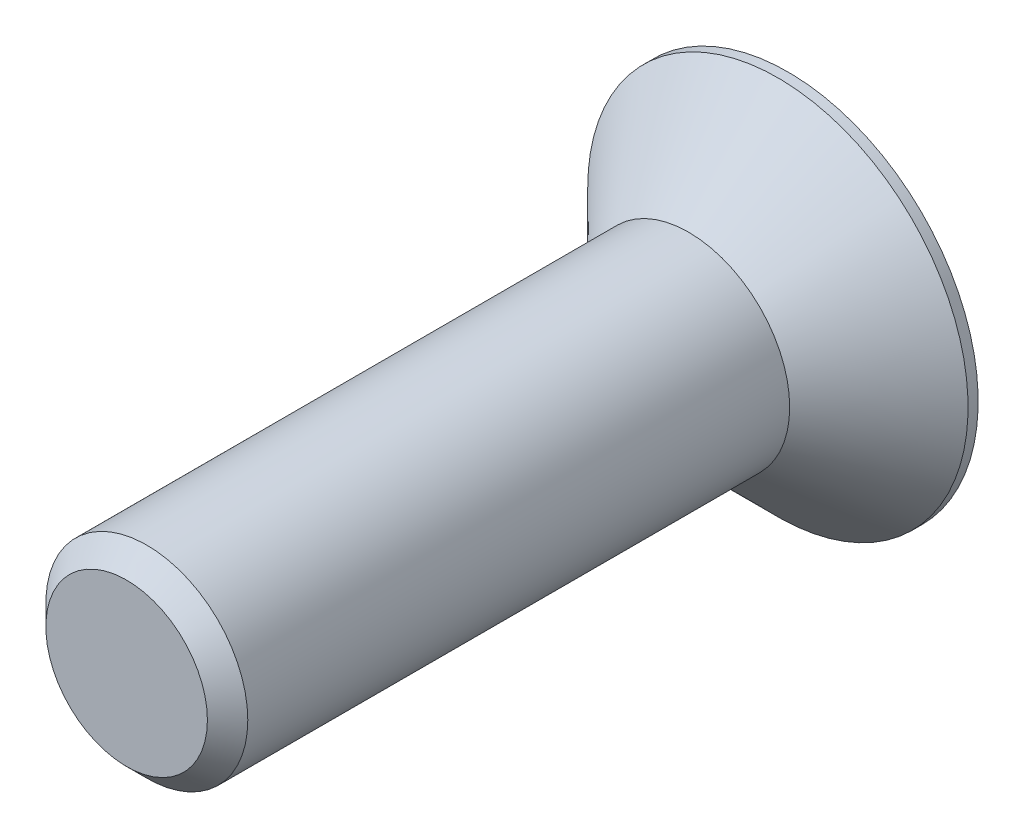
ISO-10303-21;
HEADER;
FILE_DESCRIPTION(('STEP AP214'),'2;1');
FILE_NAME('part.step','',(''),(''),'','','');
FILE_SCHEMA(('AUTOMOTIVE_DESIGN { 1 0 10303 214 1 1 1 1 }'));
ENDSEC;
DATA;
#1=APPLICATION_CONTEXT('core data for automotive mechanical design processes');
#2=APPLICATION_PROTOCOL_DEFINITION('international standard','automotive_design',2000,#1);
#3=PRODUCT_CONTEXT('',#1,'mechanical');
#4=PRODUCT('Part','Part','',(#3));
#5=PRODUCT_RELATED_PRODUCT_CATEGORY('part','',(#4));
#6=PRODUCT_DEFINITION_FORMATION('','',#4);
#7=PRODUCT_DEFINITION_CONTEXT('part definition',#1,'design');
#8=PRODUCT_DEFINITION('design','',#6,#7);
#9=PRODUCT_DEFINITION_SHAPE('','',#8);
#10=(LENGTH_UNIT() NAMED_UNIT(*) SI_UNIT(.MILLI.,.METRE.));
#11=(NAMED_UNIT(*) PLANE_ANGLE_UNIT() SI_UNIT($,.RADIAN.));
#12=(NAMED_UNIT(*) SI_UNIT($,.STERADIAN.) SOLID_ANGLE_UNIT());
#13=UNCERTAINTY_MEASURE_WITH_UNIT(LENGTH_MEASURE(1.E-05),#10,'distance_accuracy_value','');
#14=(GEOMETRIC_REPRESENTATION_CONTEXT(3) GLOBAL_UNCERTAINTY_ASSIGNED_CONTEXT((#13)) GLOBAL_UNIT_ASSIGNED_CONTEXT((#10,
#11,#12)) REPRESENTATION_CONTEXT('',''));
#15=CARTESIAN_POINT('',(0.,0.,0.));
#16=DIRECTION('',(0.,0.,1.));
#17=DIRECTION('',(1.,0.,0.));
#18=AXIS2_PLACEMENT_3D('',#15,#16,#17);
#19=CARTESIAN_POINT('',(5.65,0.,-2.94999999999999));
#20=DIRECTION('',(0.,0.,1.));
#21=DIRECTION('',(1.,0.,0.));
#22=AXIS2_PLACEMENT_3D('',#19,#20,#21);
#23=PLANE('',#22);
#24=CARTESIAN_POINT('',(0.,0.,-2.94999999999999));
#25=DIRECTION('',(0.,0.,-1.));
#26=DIRECTION('',(-1.,0.,0.));
#27=AXIS2_PLACEMENT_3D('',#24,#25,#26);
#28=CIRCLE('',#27,5.65);
#29=CARTESIAN_POINT('',(-5.65,0.,-2.94999999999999));
#30=VERTEX_POINT('',#29);
#31=EDGE_CURVE('E145',#30,#30,#28,.T.);
#32=ORIENTED_EDGE('',*,*,#31,.T.);
#33=EDGE_LOOP('',(#32));
#34=FACE_BOUND('',#33,.T.);
#35=DIRECTION('',(-0.86602540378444,0.499999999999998,0.));
#36=VECTOR('',#35,1.);
#37=CARTESIAN_POINT('',(0.,2.30940107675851,-2.94999999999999));
#38=LINE('',#37,#36);
#39=CARTESIAN_POINT('',(2.,1.15470053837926,-2.94999999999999));
#40=VERTEX_POINT('',#39);
#41=CARTESIAN_POINT('',(0.,2.30940107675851,-2.94999999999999));
#42=VERTEX_POINT('',#41);
#43=EDGE_CURVE('E50',#40,#42,#38,.T.);
#44=ORIENTED_EDGE('',*,*,#43,.T.);
#45=DIRECTION('',(-0.866025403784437,-0.500000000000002,0.));
#46=VECTOR('',#45,1.);
#47=CARTESIAN_POINT('',(-2.,1.15470053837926,-2.94999999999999));
#48=LINE('',#47,#46);
#49=CARTESIAN_POINT('',(-2.,1.15470053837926,-2.94999999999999));
#50=VERTEX_POINT('',#49);
#51=EDGE_CURVE('E121',#42,#50,#48,.T.);
#52=ORIENTED_EDGE('',*,*,#51,.T.);
#53=DIRECTION('',(0.,-1.,0.));
#54=VECTOR('',#53,1.);
#55=CARTESIAN_POINT('',(-2.,-1.15470053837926,-2.94999999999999));
#56=LINE('',#55,#54);
#57=CARTESIAN_POINT('',(-2.,-1.15470053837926,-2.94999999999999));
#58=VERTEX_POINT('',#57);
#59=EDGE_CURVE('E125',#50,#58,#56,.T.);
#60=ORIENTED_EDGE('',*,*,#59,.T.);
#61=DIRECTION('',(0.866025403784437,-0.500000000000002,0.));
#62=VECTOR('',#61,1.);
#63=CARTESIAN_POINT('',(-2.,-1.15470053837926,-2.94999999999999));
#64=LINE('',#63,#62);
#65=CARTESIAN_POINT('',(0.,-2.30940107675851,-2.94999999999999));
#66=VERTEX_POINT('',#65);
#67=EDGE_CURVE('E128',#58,#66,#64,.T.);
#68=ORIENTED_EDGE('',*,*,#67,.T.);
#69=DIRECTION('',(0.86602540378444,0.499999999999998,0.));
#70=VECTOR('',#69,1.);
#71=CARTESIAN_POINT('',(0.,-2.30940107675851,-2.94999999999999));
#72=LINE('',#71,#70);
#73=CARTESIAN_POINT('',(2.,-1.15470053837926,-2.94999999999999));
#74=VERTEX_POINT('',#73);
#75=EDGE_CURVE('E111',#66,#74,#72,.T.);
#76=ORIENTED_EDGE('',*,*,#75,.T.);
#77=DIRECTION('',(0.,1.,0.));
#78=VECTOR('',#77,1.);
#79=CARTESIAN_POINT('',(2.,-1.15470053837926,-2.94999999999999));
#80=LINE('',#79,#78);
#81=EDGE_CURVE('E131',#74,#40,#80,.T.);
#82=ORIENTED_EDGE('',*,*,#81,.T.);
#83=EDGE_LOOP('',(#44,#52,#60,#68,#76,#82));
#84=FACE_BOUND('',#83,.T.);
#85=ADVANCED_FACE('F35',(#34,#84),#23,.F.);
#86=CARTESIAN_POINT('',(0.,0.,0.));
#87=DIRECTION('',(0.,0.,-1.));
#88=DIRECTION('',(-1.,0.,0.));
#89=AXIS2_PLACEMENT_3D('',#86,#87,#88);
#90=CYLINDRICAL_SURFACE('',#89,5.65);
#91=ORIENTED_EDGE('',*,*,#31,.F.);
#92=EDGE_LOOP('',(#91));
#93=FACE_BOUND('',#92,.T.);
#94=CARTESIAN_POINT('',(0.,0.,-2.64999999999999));
#95=DIRECTION('',(0.,0.,-1.));
#96=DIRECTION('',(-1.,0.,0.));
#97=AXIS2_PLACEMENT_3D('',#94,#95,#96);
#98=CIRCLE('',#97,5.65);
#99=CARTESIAN_POINT('',(-5.65,0.,-2.64999999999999));
#100=VERTEX_POINT('',#99);
#101=EDGE_CURVE('E142',#100,#100,#98,.T.);
#102=ORIENTED_EDGE('',*,*,#101,.T.);
#103=EDGE_LOOP('',(#102));
#104=FACE_BOUND('',#103,.T.);
#105=ADVANCED_FACE('F162',(#93,#104),#90,.T.);
#106=CARTESIAN_POINT('',(0.,0.,0.));
#107=DIRECTION('',(0.,0.,-1.));
#108=DIRECTION('',(-1.,0.,0.));
#109=AXIS2_PLACEMENT_3D('',#106,#107,#108);
#110=CONICAL_SURFACE('',#109,3.,0.78539816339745);
#111=ORIENTED_EDGE('',*,*,#101,.F.);
#112=EDGE_LOOP('',(#111));
#113=FACE_BOUND('',#112,.T.);
#114=CARTESIAN_POINT('',(0.,0.,0.));
#115=DIRECTION('',(0.,0.,1.));
#116=DIRECTION('',(1.,0.,0.));
#117=AXIS2_PLACEMENT_3D('',#114,#115,#116);
#118=CIRCLE('',#117,3.);
#119=CARTESIAN_POINT('',(3.,0.,0.));
#120=VERTEX_POINT('',#119);
#121=EDGE_CURVE('E122',#120,#120,#118,.T.);
#122=ORIENTED_EDGE('',*,*,#121,.F.);
#123=EDGE_LOOP('',(#122));
#124=FACE_BOUND('',#123,.T.);
#125=ADVANCED_FACE('F167',(#113,#124),#110,.T.);
#126=CARTESIAN_POINT('',(0.,2.30940107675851,-0.149999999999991));
#127=DIRECTION('',(-0.499999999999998,-0.86602540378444,0.));
#128=DIRECTION('',(0.86602540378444,-0.499999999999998,0.));
#129=AXIS2_PLACEMENT_3D('',#126,#127,#128);
#130=PLANE('',#129);
#131=ORIENTED_EDGE('',*,*,#43,.F.);
#132=DIRECTION('',(0.,0.,-1.));
#133=VECTOR('',#132,1.);
#134=CARTESIAN_POINT('',(2.,1.15470053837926,-0.149999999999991));
#135=LINE('',#134,#133);
#136=CARTESIAN_POINT('',(2.,1.15470053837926,-0.149999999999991));
#137=VERTEX_POINT('',#136);
#138=EDGE_CURVE('E116',#137,#40,#135,.T.);
#139=ORIENTED_EDGE('',*,*,#138,.F.);
#140=DIRECTION('',(-0.86602540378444,0.499999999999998,0.));
#141=VECTOR('',#140,1.);
#142=CARTESIAN_POINT('',(0.,2.30940107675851,-0.149999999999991));
#143=LINE('',#142,#141);
#144=CARTESIAN_POINT('',(0.,2.30940107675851,-0.149999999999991));
#145=VERTEX_POINT('',#144);
#146=EDGE_CURVE('E134',#137,#145,#143,.T.);
#147=ORIENTED_EDGE('',*,*,#146,.T.);
#148=DIRECTION('',(0.,0.,-1.));
#149=VECTOR('',#148,1.);
#150=CARTESIAN_POINT('',(0.,2.30940107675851,-0.149999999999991));
#151=LINE('',#150,#149);
#152=EDGE_CURVE('E140',#145,#42,#151,.T.);
#153=ORIENTED_EDGE('',*,*,#152,.T.);
#154=EDGE_LOOP('',(#131,#139,#147,#153));
#155=FACE_BOUND('',#154,.T.);
#156=ADVANCED_FACE('F174',(#155),#130,.T.);
#157=CARTESIAN_POINT('',(-2.,1.15470053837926,-0.149999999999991));
#158=DIRECTION('',(0.500000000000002,-0.866025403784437,0.));
#159=DIRECTION('',(0.866025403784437,0.500000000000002,0.));
#160=AXIS2_PLACEMENT_3D('',#157,#158,#159);
#161=PLANE('',#160);
#162=ORIENTED_EDGE('',*,*,#51,.F.);
#163=ORIENTED_EDGE('',*,*,#152,.F.);
#164=DIRECTION('',(-0.866025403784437,-0.500000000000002,0.));
#165=VECTOR('',#164,1.);
#166=CARTESIAN_POINT('',(-2.,1.15470053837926,-0.149999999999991));
#167=LINE('',#166,#165);
#168=CARTESIAN_POINT('',(-2.,1.15470053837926,-0.149999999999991));
#169=VERTEX_POINT('',#168);
#170=EDGE_CURVE('E89',#145,#169,#167,.T.);
#171=ORIENTED_EDGE('',*,*,#170,.T.);
#172=DIRECTION('',(0.,0.,-1.));
#173=VECTOR('',#172,1.);
#174=CARTESIAN_POINT('',(-2.,1.15470053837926,-0.149999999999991));
#175=LINE('',#174,#173);
#176=EDGE_CURVE('E138',#169,#50,#175,.T.);
#177=ORIENTED_EDGE('',*,*,#176,.T.);
#178=EDGE_LOOP('',(#162,#163,#171,#177));
#179=FACE_BOUND('',#178,.T.);
#180=ADVANCED_FACE('F178',(#179),#161,.T.);
#181=CARTESIAN_POINT('',(-2.,-1.15470053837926,-0.149999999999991));
#182=DIRECTION('',(1.,0.,0.));
#183=DIRECTION('',(0.,0.,-1.));
#184=AXIS2_PLACEMENT_3D('',#181,#182,#183);
#185=PLANE('',#184);
#186=ORIENTED_EDGE('',*,*,#59,.F.);
#187=ORIENTED_EDGE('',*,*,#176,.F.);
#188=DIRECTION('',(0.,-1.,0.));
#189=VECTOR('',#188,1.);
#190=CARTESIAN_POINT('',(-2.,-1.15470053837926,-0.149999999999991));
#191=LINE('',#190,#189);
#192=CARTESIAN_POINT('',(-2.,-1.15470053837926,-0.149999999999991));
#193=VERTEX_POINT('',#192);
#194=EDGE_CURVE('E107',#169,#193,#191,.T.);
#195=ORIENTED_EDGE('',*,*,#194,.T.);
#196=DIRECTION('',(0.,0.,-1.));
#197=VECTOR('',#196,1.);
#198=CARTESIAN_POINT('',(-2.,-1.15470053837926,-0.149999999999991));
#199=LINE('',#198,#197);
#200=EDGE_CURVE('E104',#193,#58,#199,.T.);
#201=ORIENTED_EDGE('',*,*,#200,.T.);
#202=EDGE_LOOP('',(#186,#187,#195,#201));
#203=FACE_BOUND('',#202,.T.);
#204=ADVANCED_FACE('F181',(#203),#185,.T.);
#205=CARTESIAN_POINT('',(-2.,-1.15470053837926,-0.149999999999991));
#206=DIRECTION('',(0.500000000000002,0.866025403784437,0.));
#207=DIRECTION('',(-0.866025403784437,0.500000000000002,0.));
#208=AXIS2_PLACEMENT_3D('',#205,#206,#207);
#209=PLANE('',#208);
#210=ORIENTED_EDGE('',*,*,#67,.F.);
#211=ORIENTED_EDGE('',*,*,#200,.F.);
#212=DIRECTION('',(0.866025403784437,-0.500000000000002,0.));
#213=VECTOR('',#212,1.);
#214=CARTESIAN_POINT('',(-2.,-1.15470053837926,-0.149999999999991));
#215=LINE('',#214,#213);
#216=CARTESIAN_POINT('',(0.,-2.30940107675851,-0.149999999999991));
#217=VERTEX_POINT('',#216);
#218=EDGE_CURVE('E99',#193,#217,#215,.T.);
#219=ORIENTED_EDGE('',*,*,#218,.T.);
#220=DIRECTION('',(0.,0.,-1.));
#221=VECTOR('',#220,1.);
#222=CARTESIAN_POINT('',(0.,-2.30940107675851,-0.149999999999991));
#223=LINE('',#222,#221);
#224=EDGE_CURVE('E103',#217,#66,#223,.T.);
#225=ORIENTED_EDGE('',*,*,#224,.T.);
#226=EDGE_LOOP('',(#210,#211,#219,#225));
#227=FACE_BOUND('',#226,.T.);
#228=ADVANCED_FACE('F102',(#227),#209,.T.);
#229=CARTESIAN_POINT('',(0.,-2.30940107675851,-0.149999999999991));
#230=DIRECTION('',(-0.499999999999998,0.86602540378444,0.));
#231=DIRECTION('',(-0.86602540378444,-0.499999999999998,0.));
#232=AXIS2_PLACEMENT_3D('',#229,#230,#231);
#233=PLANE('',#232);
#234=ORIENTED_EDGE('',*,*,#75,.F.);
#235=ORIENTED_EDGE('',*,*,#224,.F.);
#236=DIRECTION('',(0.86602540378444,0.499999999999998,0.));
#237=VECTOR('',#236,1.);
#238=CARTESIAN_POINT('',(0.,-2.30940107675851,-0.149999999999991));
#239=LINE('',#238,#237);
#240=CARTESIAN_POINT('',(2.,-1.15470053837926,-0.149999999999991));
#241=VERTEX_POINT('',#240);
#242=EDGE_CURVE('E106',#217,#241,#239,.T.);
#243=ORIENTED_EDGE('',*,*,#242,.T.);
#244=DIRECTION('',(0.,0.,-1.));
#245=VECTOR('',#244,1.);
#246=CARTESIAN_POINT('',(2.,-1.15470053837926,-0.149999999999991));
#247=LINE('',#246,#245);
#248=EDGE_CURVE('E80',#241,#74,#247,.T.);
#249=ORIENTED_EDGE('',*,*,#248,.T.);
#250=EDGE_LOOP('',(#234,#235,#243,#249));
#251=FACE_BOUND('',#250,.T.);
#252=ADVANCED_FACE('F109',(#251),#233,.T.);
#253=CARTESIAN_POINT('',(2.,-1.15470053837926,-0.149999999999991));
#254=DIRECTION('',(-1.,0.,0.));
#255=DIRECTION('',(0.,0.,1.));
#256=AXIS2_PLACEMENT_3D('',#253,#254,#255);
#257=PLANE('',#256);
#258=ORIENTED_EDGE('',*,*,#81,.F.);
#259=ORIENTED_EDGE('',*,*,#248,.F.);
#260=DIRECTION('',(0.,1.,0.));
#261=VECTOR('',#260,1.);
#262=CARTESIAN_POINT('',(2.,-1.15470053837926,-0.149999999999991));
#263=LINE('',#262,#261);
#264=EDGE_CURVE('E58',#241,#137,#263,.T.);
#265=ORIENTED_EDGE('',*,*,#264,.T.);
#266=ORIENTED_EDGE('',*,*,#138,.T.);
#267=EDGE_LOOP('',(#258,#259,#265,#266));
#268=FACE_BOUND('',#267,.T.);
#269=ADVANCED_FACE('F190',(#268),#257,.T.);
#270=CARTESIAN_POINT('',(2.,1.15470053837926,-0.149999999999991));
#271=DIRECTION('',(0.,0.,1.));
#272=DIRECTION('',(1.,0.,0.));
#273=AXIS2_PLACEMENT_3D('',#270,#271,#272);
#274=PLANE('',#273);
#275=ORIENTED_EDGE('',*,*,#146,.F.);
#276=ORIENTED_EDGE('',*,*,#264,.F.);
#277=ORIENTED_EDGE('',*,*,#242,.F.);
#278=ORIENTED_EDGE('',*,*,#218,.F.);
#279=ORIENTED_EDGE('',*,*,#194,.F.);
#280=ORIENTED_EDGE('',*,*,#170,.F.);
#281=EDGE_LOOP('',(#275,#276,#277,#278,#279,#280));
#282=FACE_BOUND('',#281,.T.);
#283=ADVANCED_FACE('F114',(#282),#274,.F.);
#284=CARTESIAN_POINT('',(0.,0.,16.7));
#285=DIRECTION('',(0.,0.,1.));
#286=DIRECTION('',(1.,0.,0.));
#287=AXIS2_PLACEMENT_3D('',#284,#285,#286);
#288=PLANE('',#287);
#289=CARTESIAN_POINT('',(0.,0.,16.7));
#290=DIRECTION('',(0.,0.,1.));
#291=DIRECTION('',(1.,0.,0.));
#292=AXIS2_PLACEMENT_3D('',#289,#290,#291);
#293=CIRCLE('',#292,2.4);
#294=CARTESIAN_POINT('',(2.4,0.,16.7));
#295=VERTEX_POINT('',#294);
#296=EDGE_CURVE('E43',#295,#295,#293,.T.);
#297=ORIENTED_EDGE('',*,*,#296,.T.);
#298=EDGE_LOOP('',(#297));
#299=FACE_BOUND('',#298,.T.);
#300=ADVANCED_FACE('F150',(#299),#288,.T.);
#301=CARTESIAN_POINT('',(0.,0.,0.));
#302=DIRECTION('',(0.,0.,1.));
#303=DIRECTION('',(1.,0.,0.));
#304=AXIS2_PLACEMENT_3D('',#301,#302,#303);
#305=CYLINDRICAL_SURFACE('',#304,3.);
#306=CARTESIAN_POINT('',(0.,0.,16.1));
#307=DIRECTION('',(0.,0.,1.));
#308=DIRECTION('',(1.,0.,0.));
#309=AXIS2_PLACEMENT_3D('',#306,#307,#308);
#310=CIRCLE('',#309,3.);
#311=CARTESIAN_POINT('',(3.,0.,16.1));
#312=VERTEX_POINT('',#311);
#313=EDGE_CURVE('E11',#312,#312,#310,.F.);
#314=ORIENTED_EDGE('',*,*,#313,.T.);
#315=EDGE_LOOP('',(#314));
#316=FACE_BOUND('',#315,.T.);
#317=ORIENTED_EDGE('',*,*,#121,.T.);
#318=EDGE_LOOP('',(#317));
#319=FACE_BOUND('',#318,.T.);
#320=ADVANCED_FACE('F153',(#316,#319),#305,.T.);
#321=CARTESIAN_POINT('',(0.,0.,16.7));
#322=DIRECTION('',(0.,0.,-1.));
#323=DIRECTION('',(-1.,0.,0.));
#324=AXIS2_PLACEMENT_3D('',#321,#322,#323);
#325=CONICAL_SURFACE('',#324,2.4,0.785398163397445);
#326=ORIENTED_EDGE('',*,*,#313,.F.);
#327=EDGE_LOOP('',(#326));
#328=FACE_BOUND('',#327,.T.);
#329=ORIENTED_EDGE('',*,*,#296,.F.);
#330=EDGE_LOOP('',(#329));
#331=FACE_BOUND('',#330,.T.);
#332=ADVANCED_FACE('F37',(#328,#331),#325,.T.);
#333=CLOSED_SHELL('',(#85,#105,#125,#156,#180,#204,#228,#252,#269,#283,#300,#320,#332));
#334=MANIFOLD_SOLID_BREP('B2',#333);
#335=ADVANCED_BREP_SHAPE_REPRESENTATION('',(#18,#334),#14);
#336=SHAPE_DEFINITION_REPRESENTATION(#9,#335);
ENDSEC;
END-ISO-10303-21;
